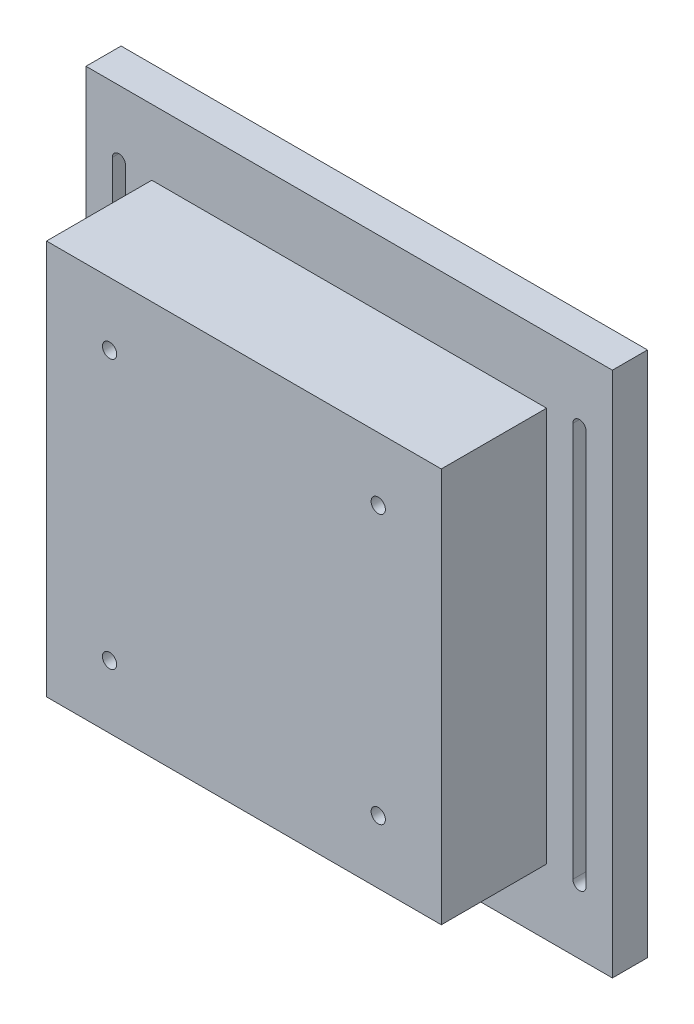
from build123d import *

# Parameters (mm, degrees)
SKIZZE1_W                       = 240
SKIZZE1_H                       = 240
AUFSATZ_LINEAR_AUSTRAGEN1_DEPTH = 16
SKIZZE2_W                       = 180
SKIZZE2_H                       = 180
AUFSATZ_LINEAR_AUSTRAGEN2_DEPTH = 48
SKIZZE3_W                       = 160
SKIZZE3_H                       = 160
SCHNITT_LINEAR_AUSTRAGEN1_DEPTH = 48
SCHNITT_LINEAR_AUSTRAGEN2_REACH = 344.789
SCHNITT_LINEAR_AUSTRAGEN3_REACH = 347.393
SKIZZE4_R                       = 3.25


with BuildPart() as part:
    # Skizze1 → Aufsatz-Linear austragen1 (new body)
    with BuildSketch(Plane.XY):
        with Locations((120, 120)):
            Rectangle(SKIZZE1_W, SKIZZE1_H)
    extrude(amount=AUFSATZ_LINEAR_AUSTRAGEN1_DEPTH)

    # Skizze2 → Aufsatz-Linear austragen2 (add)
    with BuildSketch(Plane.XY.offset(16)):
        with Locations((120, 120)):
            Rectangle(SKIZZE2_W, SKIZZE2_H)
    extrude(amount=AUFSATZ_LINEAR_AUSTRAGEN2_DEPTH)

    # Skizze3 → Schnitt-Linear austragen1 (cut)
    with BuildSketch(Plane(origin=(0, 0, 0), x_dir=(-1, 0, 0), z_dir=(0, 0, -1))):
        with Locations((-120, 120)):
            Rectangle(SKIZZE3_W, SKIZZE3_H)
    extrude(amount=-SCHNITT_LINEAR_AUSTRAGEN1_DEPTH, mode=Mode.SUBTRACT)

    # Skizze5 → Schnitt-Linear austragen2 (cut, up to next)
    with BuildSketch(Plane.XY.offset(16), mode=Mode.PRIVATE) as schnitt_linear_austragen2_sk1:
        with BuildLine():
            Line((18, 210), (18, 30))
            ThreePointArc((18, 30), (15, 27), (12, 30))
            Line((12, 30), (12, 210))
            ThreePointArc((12, 210), (15, 213), (18, 210))
        make_face()
    schnitt_linear_austragen2_tool1 = extrude(schnitt_linear_austragen2_sk1.sketch, amount=-SCHNITT_LINEAR_AUSTRAGEN2_REACH, mode=Mode.PRIVATE) & part.part
    # Skizze5 → Schnitt-Linear austragen2 (cut, up to next)
    with BuildSketch(Plane.XY.offset(16), mode=Mode.PRIVATE) as schnitt_linear_austragen2_sk2:
        with BuildLine():
            Line((222, 210), (222, 30))
            ThreePointArc((222, 30), (225, 27), (228, 30))
            Line((228, 30), (228, 210))
            ThreePointArc((228, 210), (225, 213), (222, 210))
        make_face()
    schnitt_linear_austragen2_tool2 = extrude(schnitt_linear_austragen2_sk2.sketch, amount=-SCHNITT_LINEAR_AUSTRAGEN2_REACH, mode=Mode.PRIVATE) & part.part
    add(schnitt_linear_austragen2_tool1.solids().sort_by_distance((15, 120, 16))[0], mode=Mode.SUBTRACT)
    add(schnitt_linear_austragen2_tool2.solids().sort_by_distance((225, 120, 16))[0], mode=Mode.SUBTRACT)

    # Skizze4 → Schnitt-Linear austragen3 (cut, up to next)
    with BuildSketch(Plane.XY.offset(64), mode=Mode.PRIVATE) as schnitt_linear_austragen3_sk1:
        with Locations((181.25, 181.25)):
            Circle(SKIZZE4_R)
    schnitt_linear_austragen3_tool1 = extrude(schnitt_linear_austragen3_sk1.sketch, amount=-SCHNITT_LINEAR_AUSTRAGEN3_REACH, mode=Mode.PRIVATE) & part.part
    # Skizze4 → Schnitt-Linear austragen3 (cut, up to next)
    with BuildSketch(Plane.XY.offset(64), mode=Mode.PRIVATE) as schnitt_linear_austragen3_sk2:
        with Locations(Location((58.75, 181.25, 0), (0, 0, 180))):
            Circle(SKIZZE4_R)
    schnitt_linear_austragen3_tool2 = extrude(schnitt_linear_austragen3_sk2.sketch, amount=-SCHNITT_LINEAR_AUSTRAGEN3_REACH, mode=Mode.PRIVATE) & part.part
    # Skizze4 → Schnitt-Linear austragen3 (cut, up to next)
    with BuildSketch(Plane.XY.offset(64), mode=Mode.PRIVATE) as schnitt_linear_austragen3_sk3:
        with Locations((58.75, 58.75)):
            Circle(SKIZZE4_R)
    schnitt_linear_austragen3_tool3 = extrude(schnitt_linear_austragen3_sk3.sketch, amount=-SCHNITT_LINEAR_AUSTRAGEN3_REACH, mode=Mode.PRIVATE) & part.part
    # Skizze4 → Schnitt-Linear austragen3 (cut, up to next)
    with BuildSketch(Plane.XY.offset(64), mode=Mode.PRIVATE) as schnitt_linear_austragen3_sk4:
        with Locations(Location((181.25, 58.75, 0), (0, 0, 180))):
            Circle(SKIZZE4_R)
    schnitt_linear_austragen3_tool4 = extrude(schnitt_linear_austragen3_sk4.sketch, amount=-SCHNITT_LINEAR_AUSTRAGEN3_REACH, mode=Mode.PRIVATE) & part.part
    add(schnitt_linear_austragen3_tool1.solids().sort_by_distance((181.25, 181.25, 64))[0], mode=Mode.SUBTRACT)
    add(schnitt_linear_austragen3_tool2.solids().sort_by_distance((58.75, 181.25, 64))[0], mode=Mode.SUBTRACT)
    add(schnitt_linear_austragen3_tool3.solids().sort_by_distance((58.75, 58.75, 64))[0], mode=Mode.SUBTRACT)
    add(schnitt_linear_austragen3_tool4.solids().sort_by_distance((181.25, 58.75, 64))[0], mode=Mode.SUBTRACT)


solid = part.part
